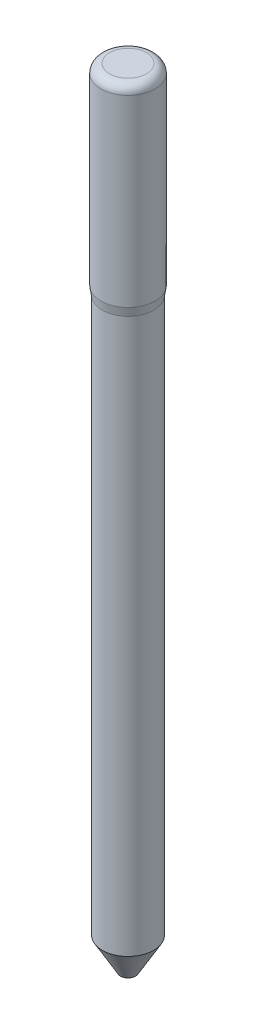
ISO-10303-21;
HEADER;
FILE_DESCRIPTION(('STEP AP214'),'2;1');
FILE_NAME('part.step','',(''),(''),'','','');
FILE_SCHEMA(('AUTOMOTIVE_DESIGN { 1 0 10303 214 1 1 1 1 }'));
ENDSEC;
DATA;
#1=APPLICATION_CONTEXT('core data for automotive mechanical design processes');
#2=APPLICATION_PROTOCOL_DEFINITION('international standard','automotive_design',2000,#1);
#3=PRODUCT_CONTEXT('',#1,'mechanical');
#4=PRODUCT('Part','Part','',(#3));
#5=PRODUCT_RELATED_PRODUCT_CATEGORY('part','',(#4));
#6=PRODUCT_DEFINITION_FORMATION('','',#4);
#7=PRODUCT_DEFINITION_CONTEXT('part definition',#1,'design');
#8=PRODUCT_DEFINITION('design','',#6,#7);
#9=PRODUCT_DEFINITION_SHAPE('','',#8);
#10=(LENGTH_UNIT() NAMED_UNIT(*) SI_UNIT(.MILLI.,.METRE.));
#11=(NAMED_UNIT(*) PLANE_ANGLE_UNIT() SI_UNIT($,.RADIAN.));
#12=(NAMED_UNIT(*) SI_UNIT($,.STERADIAN.) SOLID_ANGLE_UNIT());
#13=UNCERTAINTY_MEASURE_WITH_UNIT(LENGTH_MEASURE(1.E-05),#10,'distance_accuracy_value','');
#14=(GEOMETRIC_REPRESENTATION_CONTEXT(3) GLOBAL_UNCERTAINTY_ASSIGNED_CONTEXT((#13)) GLOBAL_UNIT_ASSIGNED_CONTEXT((#10,
#11,#12)) REPRESENTATION_CONTEXT('',''));
#15=CARTESIAN_POINT('',(0.,0.,0.));
#16=DIRECTION('',(0.,0.,1.));
#17=DIRECTION('',(1.,0.,0.));
#18=AXIS2_PLACEMENT_3D('',#15,#16,#17);
#19=CARTESIAN_POINT('',(0.,0.,0.));
#20=DIRECTION('',(0.,-1.,0.));
#21=DIRECTION('',(0.,0.,-1.));
#22=AXIS2_PLACEMENT_3D('',#19,#20,#21);
#23=PLANE('',#22);
#24=CARTESIAN_POINT('',(0.,0.,0.));
#25=DIRECTION('',(0.,-1.,0.));
#26=DIRECTION('',(0.,0.,-1.));
#27=AXIS2_PLACEMENT_3D('',#24,#25,#26);
#28=CIRCLE('',#27,0.215384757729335);
#29=CARTESIAN_POINT('',(0.,0.,0.215384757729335));
#30=VERTEX_POINT('',#29);
#31=EDGE_CURVE('E10',#30,#30,#28,.T.);
#32=ORIENTED_EDGE('',*,*,#31,.T.);
#33=EDGE_LOOP('',(#32));
#34=FACE_BOUND('',#33,.T.);
#35=ADVANCED_FACE('F35',(#34),#23,.T.);
#36=CARTESIAN_POINT('',(0.,0.,0.));
#37=DIRECTION('',(0.,1.,0.));
#38=DIRECTION('',(0.,0.,1.));
#39=AXIS2_PLACEMENT_3D('',#36,#37,#38);
#40=CONICAL_SURFACE('',#39,0.215384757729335,0.5235987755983);
#41=CARTESIAN_POINT('',(0.,0.9,0.));
#42=DIRECTION('',(0.,-1.,0.));
#43=DIRECTION('',(0.,0.,-1.));
#44=AXIS2_PLACEMENT_3D('',#41,#42,#43);
#45=CIRCLE('',#44,0.735);
#46=CARTESIAN_POINT('',(0.,0.9,0.735));
#47=VERTEX_POINT('',#46);
#48=EDGE_CURVE('E41',#47,#47,#45,.T.);
#49=CARTESIAN_POINT('',(0.,0.9,0.735));
#50=CARTESIAN_POINT('',(0.,0.890625,0.729587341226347));
#51=CARTESIAN_POINT('',(0.,0.88125,0.724174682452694));
#52=CARTESIAN_POINT('',(0.,0.8625,0.713349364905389));
#53=CARTESIAN_POINT('',(0.,0.853125,0.707936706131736));
#54=CARTESIAN_POINT('',(0.,0.834375,0.697111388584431));
#55=CARTESIAN_POINT('',(0.,0.825,0.691698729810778));
#56=CARTESIAN_POINT('',(0.,0.80625,0.680873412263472));
#57=CARTESIAN_POINT('',(0.,0.796875,0.67546075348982));
#58=CARTESIAN_POINT('',(0.,0.778125,0.664635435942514));
#59=CARTESIAN_POINT('',(0.,0.76875,0.659222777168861));
#60=CARTESIAN_POINT('',(0.,0.75,0.648397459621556));
#61=CARTESIAN_POINT('',(0.,0.740625,0.642984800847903));
#62=CARTESIAN_POINT('',(0.,0.721875,0.632159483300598));
#63=CARTESIAN_POINT('',(0.,0.7125,0.626746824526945));
#64=CARTESIAN_POINT('',(0.,0.69375,0.615921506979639));
#65=CARTESIAN_POINT('',(0.,0.684375,0.610508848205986));
#66=CARTESIAN_POINT('',(0.,0.665625,0.599683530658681));
#67=CARTESIAN_POINT('',(0.,0.65625,0.594270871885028));
#68=CARTESIAN_POINT('',(0.,0.6375,0.583445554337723));
#69=CARTESIAN_POINT('',(0.,0.628125,0.57803289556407));
#70=CARTESIAN_POINT('',(0.,0.609375,0.567207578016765));
#71=CARTESIAN_POINT('',(0.,0.6,0.561794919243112));
#72=CARTESIAN_POINT('',(0.,0.58125,0.550969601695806));
#73=CARTESIAN_POINT('',(0.,0.571875,0.545556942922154));
#74=CARTESIAN_POINT('',(0.,0.553125,0.534731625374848));
#75=CARTESIAN_POINT('',(0.,0.54375,0.529318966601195));
#76=CARTESIAN_POINT('',(0.,0.525,0.51849364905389));
#77=CARTESIAN_POINT('',(0.,0.515625,0.513080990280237));
#78=CARTESIAN_POINT('',(0.,0.496875,0.502255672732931));
#79=CARTESIAN_POINT('',(0.,0.4875,0.496843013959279));
#80=CARTESIAN_POINT('',(0.,0.46875,0.486017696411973));
#81=CARTESIAN_POINT('',(0.,0.459375,0.48060503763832));
#82=CARTESIAN_POINT('',(0.,0.440625,0.469779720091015));
#83=CARTESIAN_POINT('',(0.,0.43125,0.464367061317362));
#84=CARTESIAN_POINT('',(0.,0.4125,0.453541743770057));
#85=CARTESIAN_POINT('',(0.,0.403125,0.448129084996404));
#86=CARTESIAN_POINT('',(0.,0.384375,0.437303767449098));
#87=CARTESIAN_POINT('',(0.,0.375,0.431891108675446));
#88=CARTESIAN_POINT('',(0.,0.35625,0.42106579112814));
#89=CARTESIAN_POINT('',(0.,0.346875,0.415653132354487));
#90=CARTESIAN_POINT('',(0.,0.328125,0.404827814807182));
#91=CARTESIAN_POINT('',(0.,0.31875,0.399415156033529));
#92=CARTESIAN_POINT('',(0.,0.3,0.388589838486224));
#93=CARTESIAN_POINT('',(0.,0.290625,0.383177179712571));
#94=CARTESIAN_POINT('',(0.,0.271875,0.372351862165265));
#95=CARTESIAN_POINT('',(0.,0.2625,0.366939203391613));
#96=CARTESIAN_POINT('',(0.,0.24375,0.356113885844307));
#97=CARTESIAN_POINT('',(0.,0.234375,0.350701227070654));
#98=CARTESIAN_POINT('',(0.,0.215625,0.339875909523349));
#99=CARTESIAN_POINT('',(0.,0.20625,0.334463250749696));
#100=CARTESIAN_POINT('',(0.,0.1875,0.323637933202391));
#101=CARTESIAN_POINT('',(0.,0.178125,0.318225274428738));
#102=CARTESIAN_POINT('',(0.,0.159375,0.307399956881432));
#103=CARTESIAN_POINT('',(0.,0.15,0.301987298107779));
#104=CARTESIAN_POINT('',(0.,0.13125,0.291161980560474));
#105=CARTESIAN_POINT('',(0.,0.121875,0.285749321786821));
#106=CARTESIAN_POINT('',(0.,0.103125,0.274924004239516));
#107=CARTESIAN_POINT('',(0.,0.09375,0.269511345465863));
#108=CARTESIAN_POINT('',(0.,0.075,0.258686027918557));
#109=CARTESIAN_POINT('',(0.,0.065625,0.253273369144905));
#110=CARTESIAN_POINT('',(0.,0.046875,0.242448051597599));
#111=CARTESIAN_POINT('',(0.,0.0375,0.237035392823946));
#112=CARTESIAN_POINT('',(0.,0.01875,0.226210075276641));
#113=CARTESIAN_POINT('',(0.,0.00937500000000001,0.220797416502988));
#114=CARTESIAN_POINT('',(0.,0.,0.215384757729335));
#115=B_SPLINE_CURVE_WITH_KNOTS('',3,(#49,#50,#51,#52,#53,#54,#55,#56,#57,#58,#59,#60,#61,#62,
#63,#64,#65,#66,#67,#68,#69,#70,#71,#72,#73,#74,#75,#76,#77,#78,#79,#80,#81,#82,#83,#84,#85,#86,
#87,#88,#89,#90,#91,#92,#93,#94,#95,#96,#97,#98,#99,#100,#101,#102,#103,#104,#105,#106,#107,
#108,#109,#110,#111,#112,#113,#114),.UNSPECIFIED.,.F.,.F.,(4,2,2,2,2,2,2,2,2,2,2,2,2,2,2,2,2,2,
2,2,2,2,2,2,2,2,2,2,2,2,2,2,4),(0.,0.0324759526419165,0.0649519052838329,0.0974278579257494,
0.129903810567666,0.162379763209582,0.194855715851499,0.227331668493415,0.259807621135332,
0.292283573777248,0.324759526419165,0.357235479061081,0.389711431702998,0.422187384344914,
0.454663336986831,0.487139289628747,0.519615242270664,0.55209119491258,0.584567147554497,
0.617043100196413,0.64951905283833,0.681995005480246,0.714470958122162,0.746946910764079,
0.779422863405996,0.811898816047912,0.844374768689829,0.876850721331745,0.909326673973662,
0.941802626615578,0.974278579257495,1.00675453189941,1.03923048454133),.UNSPECIFIED.);
#116=EDGE_CURVE('BSEAM73',#47,#30,#115,.T.);
#117=ORIENTED_EDGE('',*,*,#48,.T.);
#118=ORIENTED_EDGE('',*,*,#31,.F.);
#119=ORIENTED_EDGE('',*,*,#116,.T.);
#120=ORIENTED_EDGE('',*,*,#116,.F.);
#121=EDGE_LOOP('',(#117,#119,#118,#120));
#122=FACE_BOUND('',#121,.T.);
#123=ADVANCED_FACE('F73',(#122),#40,.T.);
#124=CARTESIAN_POINT('',(0.,0.,0.));
#125=DIRECTION('',(0.,-1.,0.));
#126=DIRECTION('',(0.,0.,-1.));
#127=AXIS2_PLACEMENT_3D('',#124,#125,#126);
#128=CYLINDRICAL_SURFACE('',#127,0.735);
#129=CARTESIAN_POINT('',(0.,16.75,0.));
#130=DIRECTION('',(0.,-1.,0.));
#131=DIRECTION('',(0.,0.,-1.));
#132=AXIS2_PLACEMENT_3D('',#129,#130,#131);
#133=CIRCLE('',#132,0.735);
#134=CARTESIAN_POINT('',(0.,16.75,-0.735));
#135=VERTEX_POINT('',#134);
#136=EDGE_CURVE('E45',#135,#135,#133,.T.);
#137=ORIENTED_EDGE('',*,*,#136,.T.);
#138=EDGE_LOOP('',(#137));
#139=FACE_BOUND('',#138,.T.);
#140=ORIENTED_EDGE('',*,*,#48,.F.);
#141=EDGE_LOOP('',(#140));
#142=FACE_BOUND('',#141,.T.);
#143=ADVANCED_FACE('F77',(#139,#142),#128,.T.);
#144=CARTESIAN_POINT('',(0.,16.75,0.));
#145=DIRECTION('',(0.,1.,0.));
#146=DIRECTION('',(0.,0.,1.));
#147=AXIS2_PLACEMENT_3D('',#144,#145,#146);
#148=CONICAL_SURFACE('',#147,0.735,0.158655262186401);
#149=CARTESIAN_POINT('',(0.,17.,0.));
#150=DIRECTION('',(0.,-1.,0.));
#151=DIRECTION('',(0.,0.,-1.));
#152=AXIS2_PLACEMENT_3D('',#149,#150,#151);
#153=CIRCLE('',#152,0.775);
#154=CARTESIAN_POINT('',(0.,17.,-0.775));
#155=VERTEX_POINT('',#154);
#156=EDGE_CURVE('E49',#155,#155,#153,.T.);
#157=ORIENTED_EDGE('',*,*,#156,.T.);
#158=EDGE_LOOP('',(#157));
#159=FACE_BOUND('',#158,.T.);
#160=ORIENTED_EDGE('',*,*,#136,.F.);
#161=EDGE_LOOP('',(#160));
#162=FACE_BOUND('',#161,.T.);
#163=ADVANCED_FACE('F81',(#159,#162),#148,.T.);
#164=CARTESIAN_POINT('',(0.,0.,0.));
#165=DIRECTION('',(0.,-1.,0.));
#166=DIRECTION('',(0.,0.,-1.));
#167=AXIS2_PLACEMENT_3D('',#164,#165,#166);
#168=CYLINDRICAL_SURFACE('',#167,0.775);
#169=CARTESIAN_POINT('',(0.,22.25,0.));
#170=DIRECTION('',(0.,-1.,0.));
#171=DIRECTION('',(0.,0.,-1.));
#172=AXIS2_PLACEMENT_3D('',#169,#170,#171);
#173=CIRCLE('',#172,0.775);
#174=CARTESIAN_POINT('',(0.,22.25,-0.775));
#175=VERTEX_POINT('',#174);
#176=EDGE_CURVE('E54',#175,#175,#173,.T.);
#177=ORIENTED_EDGE('',*,*,#176,.T.);
#178=EDGE_LOOP('',(#177));
#179=FACE_BOUND('',#178,.T.);
#180=ORIENTED_EDGE('',*,*,#156,.F.);
#181=EDGE_LOOP('',(#180));
#182=FACE_BOUND('',#181,.T.);
#183=ADVANCED_FACE('F70',(#179,#182),#168,.T.);
#184=CARTESIAN_POINT('',(0.,22.25,0.));
#185=DIRECTION('',(0.,-1.,0.));
#186=DIRECTION('',(0.,0.,-1.));
#187=AXIS2_PLACEMENT_3D('',#184,#185,#186);
#188=TOROIDAL_SURFACE('',#187,0.525,0.25);
#189=CARTESIAN_POINT('',(0.,22.5,0.));
#190=DIRECTION('',(0.,-1.,0.));
#191=DIRECTION('',(0.,0.,-1.));
#192=AXIS2_PLACEMENT_3D('',#189,#190,#191);
#193=CIRCLE('',#192,0.525);
#194=CARTESIAN_POINT('',(0.,22.5,-0.525));
#195=VERTEX_POINT('',#194);
#196=EDGE_CURVE('E57',#195,#195,#193,.T.);
#197=ORIENTED_EDGE('',*,*,#196,.T.);
#198=EDGE_LOOP('',(#197));
#199=FACE_BOUND('',#198,.T.);
#200=ORIENTED_EDGE('',*,*,#176,.F.);
#201=EDGE_LOOP('',(#200));
#202=FACE_BOUND('',#201,.T.);
#203=ADVANCED_FACE('F61',(#199,#202),#188,.T.);
#204=CARTESIAN_POINT('',(0.525,22.5,0.));
#205=DIRECTION('',(0.,1.,0.));
#206=DIRECTION('',(0.,0.,1.));
#207=AXIS2_PLACEMENT_3D('',#204,#205,#206);
#208=PLANE('',#207);
#209=ORIENTED_EDGE('',*,*,#196,.F.);
#210=EDGE_LOOP('',(#209));
#211=FACE_BOUND('',#210,.T.);
#212=ADVANCED_FACE('F64',(#211),#208,.T.);
#213=CLOSED_SHELL('',(#35,#123,#143,#163,#183,#203,#212));
#214=MANIFOLD_SOLID_BREP('B2',#213);
#215=ADVANCED_BREP_SHAPE_REPRESENTATION('',(#18,#214),#14);
#216=SHAPE_DEFINITION_REPRESENTATION(#9,#215);
ENDSEC;
END-ISO-10303-21;
